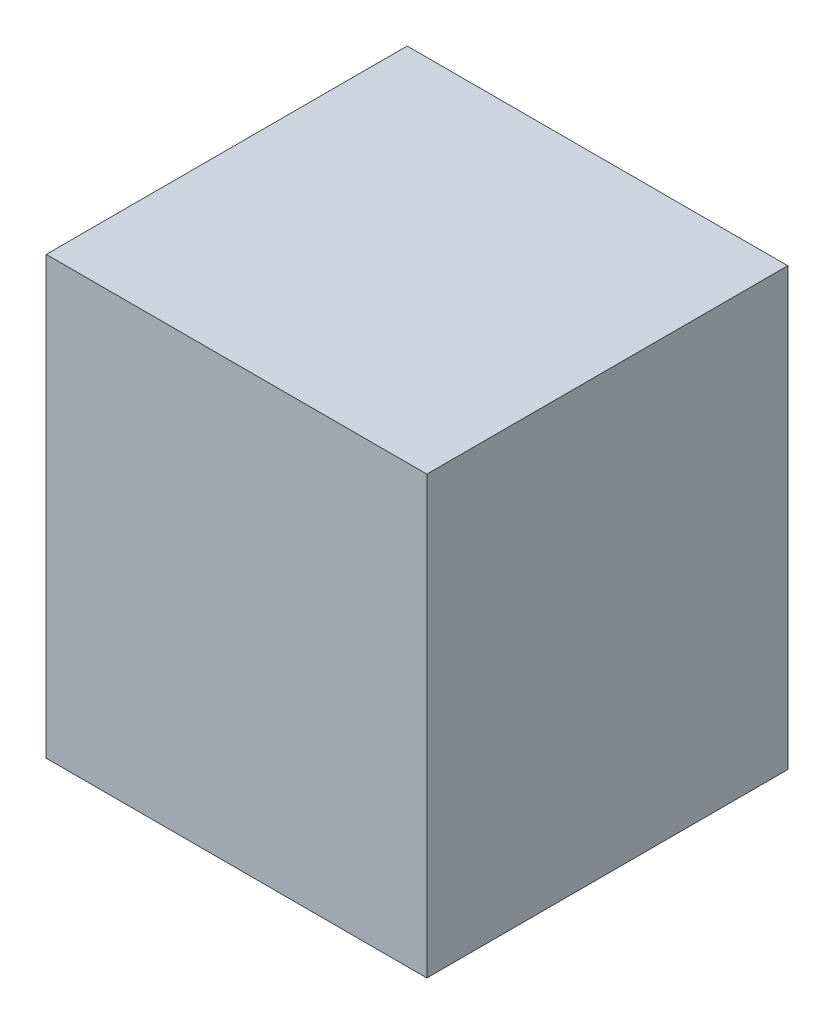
from build123d import *

# Parameters (mm, degrees)
SKETCH1_W           = 169.702805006
SKETCH1_H           = 160.925073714
BOSS_EXTRUDE1_DEPTH = 194.564


with BuildPart() as part:
    # Sketch1 → Boss-Extrude1 (new body)
    with BuildSketch(Plane(origin=(0, 0, 0), x_dir=(1, 0, 0), z_dir=(0, 1, 0))):
        Rectangle(SKETCH1_W, SKETCH1_H)
    extrude(amount=BOSS_EXTRUDE1_DEPTH)


solid = part.part
